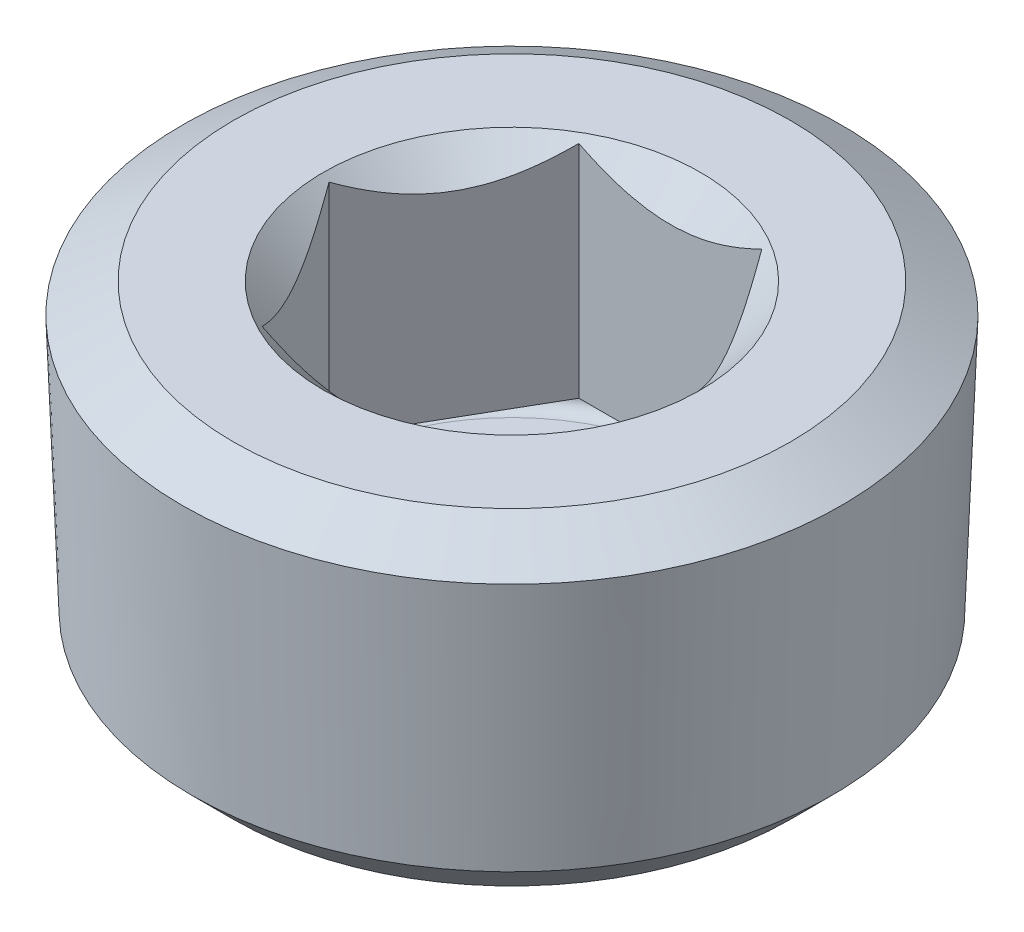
from build123d import *

# Parameters (mm, degrees)
CUT_EXTRUDE1_START = -11.43
CUT_EXTRUDE1_DEPTH = 11.143759


with BuildPart() as part:
    # Sketch2 → Revolve1 (revolve)
    with BuildSketch(Plane.XY, mode=Mode.PRIVATE) as revolve1_sk:
        Polygon((0, 0), (-14.066568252, 0), (-16.646200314, -1.489351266), (-16.175455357, -14.401112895), (-14.066568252, -16.51), (0, -16.51), align=None)
    revolve(revolve1_sk.sketch.rotate(Axis((0, 10.744282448, 0), (0, -1, 0)), 270), axis=Axis((0, 10.744282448, 0), (0, -1, 0)))

    # Sketch3 → Cut-Revolve1 (revolve, cut)
    with BuildSketch(Plane.XY, mode=Mode.PRIVATE) as cut_revolve1_sk:
        with BuildLine():
            Line((0, 0), (-9.525, 0))
            Line((-9.525, 0), (-8.001, -1.524))
            Line((-8.001, -1.524), (-8.001, -11.43))
            Line((-8.001, -11.43), (-9.525, -11.43))
            ThreePointArc((-9.525, -11.43), (-10.16, -12.065), (-9.525, -12.7))
            Line((-9.525, -12.7), (0, -12.7))
            Line((0, -12.7), (0, 0))
        make_face()
    revolve(cut_revolve1_sk.sketch.rotate(Axis((0, 2.934222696, 0), (0, -1, 0)), 270), axis=Axis((0, 2.934222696, 0), (0, -1, 0)), mode=Mode.SUBTRACT)

    # Sketch4 → Cut-Extrude1 (cut)
    with BuildSketch(Plane(origin=(0, 0, 0), x_dir=(1, 0, 0), z_dir=(0, 1, 0)).offset(CUT_EXTRUDE1_START)):
        Polygon((-4.619379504, -8.001), (4.619379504, -8.001), (9.238759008, 0), (4.619379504, 8.001), (-4.619379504, 8.001), (-9.238759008, 0), align=None)
    extrude(amount=CUT_EXTRUDE1_DEPTH, mode=Mode.SUBTRACT)


solid = part.part
